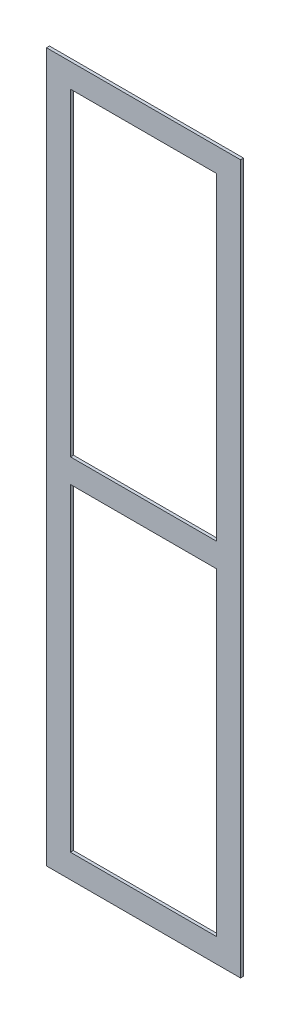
ISO-10303-21;
HEADER;
FILE_DESCRIPTION(('STEP AP214'),'2;1');
FILE_NAME('part.step','',(''),(''),'','','');
FILE_SCHEMA(('AUTOMOTIVE_DESIGN { 1 0 10303 214 1 1 1 1 }'));
ENDSEC;
DATA;
#1=APPLICATION_CONTEXT('core data for automotive mechanical design processes');
#2=APPLICATION_PROTOCOL_DEFINITION('international standard','automotive_design',2000,#1);
#3=PRODUCT_CONTEXT('',#1,'mechanical');
#4=PRODUCT('Part','Part','',(#3));
#5=PRODUCT_RELATED_PRODUCT_CATEGORY('part','',(#4));
#6=PRODUCT_DEFINITION_FORMATION('','',#4);
#7=PRODUCT_DEFINITION_CONTEXT('part definition',#1,'design');
#8=PRODUCT_DEFINITION('design','',#6,#7);
#9=PRODUCT_DEFINITION_SHAPE('','',#8);
#10=(LENGTH_UNIT() NAMED_UNIT(*) SI_UNIT(.MILLI.,.METRE.));
#11=(NAMED_UNIT(*) PLANE_ANGLE_UNIT() SI_UNIT($,.RADIAN.));
#12=(NAMED_UNIT(*) SI_UNIT($,.STERADIAN.) SOLID_ANGLE_UNIT());
#13=UNCERTAINTY_MEASURE_WITH_UNIT(LENGTH_MEASURE(1.E-05),#10,'distance_accuracy_value','');
#14=(GEOMETRIC_REPRESENTATION_CONTEXT(3) GLOBAL_UNCERTAINTY_ASSIGNED_CONTEXT((#13)) GLOBAL_UNIT_ASSIGNED_CONTEXT((#10,
#11,#12)) REPRESENTATION_CONTEXT('',''));
#15=CARTESIAN_POINT('',(0.,0.,0.));
#16=DIRECTION('',(0.,0.,1.));
#17=DIRECTION('',(1.,0.,0.));
#18=AXIS2_PLACEMENT_3D('',#15,#16,#17);
#19=CARTESIAN_POINT('',(0.,376.8,0.));
#20=DIRECTION('',(0.,-1.,0.));
#21=DIRECTION('',(0.,0.,-1.));
#22=AXIS2_PLACEMENT_3D('',#19,#20,#21);
#23=PLANE('',#22);
#24=DIRECTION('',(0.,0.,-1.));
#25=VECTOR('',#24,1.);
#26=CARTESIAN_POINT('',(51.5875,376.8,-51.5875));
#27=LINE('',#26,#25);
#28=CARTESIAN_POINT('',(51.5875,376.8,51.5875));
#29=VERTEX_POINT('',#28);
#30=CARTESIAN_POINT('',(51.5875,376.8,50.));
#31=VERTEX_POINT('',#30);
#32=EDGE_CURVE('E201',#29,#31,#27,.T.);
#33=ORIENTED_EDGE('',*,*,#32,.T.);
#34=DIRECTION('',(1.,0.,0.));
#35=VECTOR('',#34,1.);
#36=CARTESIAN_POINT('',(50.,376.8,50.));
#37=LINE('',#36,#35);
#38=CARTESIAN_POINT('',(-51.5875,376.8,50.));
#39=VERTEX_POINT('',#38);
#40=EDGE_CURVE('E54',#39,#31,#37,.T.);
#41=ORIENTED_EDGE('',*,*,#40,.F.);
#42=DIRECTION('',(0.,0.,1.));
#43=VECTOR('',#42,1.);
#44=CARTESIAN_POINT('',(-51.5875,376.8,-51.5875));
#45=LINE('',#44,#43);
#46=CARTESIAN_POINT('',(-51.5875,376.8,51.5875));
#47=VERTEX_POINT('',#46);
#48=EDGE_CURVE('E199',#39,#47,#45,.T.);
#49=ORIENTED_EDGE('',*,*,#48,.T.);
#50=DIRECTION('',(1.,0.,0.));
#51=VECTOR('',#50,1.);
#52=CARTESIAN_POINT('',(51.5875,376.8,51.5875));
#53=LINE('',#52,#51);
#54=EDGE_CURVE('E197',#47,#29,#53,.T.);
#55=ORIENTED_EDGE('',*,*,#54,.T.);
#56=EDGE_LOOP('',(#33,#41,#49,#55));
#57=FACE_BOUND('',#56,.T.);
#58=ADVANCED_FACE('F36',(#57),#23,.F.);
#59=CARTESIAN_POINT('',(0.,0.,0.));
#60=DIRECTION('',(0.,-1.,0.));
#61=DIRECTION('',(0.,0.,-1.));
#62=AXIS2_PLACEMENT_3D('',#59,#60,#61);
#63=PLANE('',#62);
#64=DIRECTION('',(1.,0.,0.));
#65=VECTOR('',#64,1.);
#66=CARTESIAN_POINT('',(-51.6,0.,50.));
#67=LINE('',#66,#65);
#68=CARTESIAN_POINT('',(-51.5875,0.,50.));
#69=VERTEX_POINT('',#68);
#70=CARTESIAN_POINT('',(51.5875,0.,50.));
#71=VERTEX_POINT('',#70);
#72=EDGE_CURVE('E195',#69,#71,#67,.T.);
#73=ORIENTED_EDGE('',*,*,#72,.T.);
#74=DIRECTION('',(0.,0.,-1.));
#75=VECTOR('',#74,1.);
#76=CARTESIAN_POINT('',(51.5875,0.,-51.5875));
#77=LINE('',#76,#75);
#78=CARTESIAN_POINT('',(51.5875,0.,51.5875));
#79=VERTEX_POINT('',#78);
#80=EDGE_CURVE('E196',#79,#71,#77,.T.);
#81=ORIENTED_EDGE('',*,*,#80,.F.);
#82=DIRECTION('',(1.,0.,0.));
#83=VECTOR('',#82,1.);
#84=CARTESIAN_POINT('',(51.5875,0.,51.5875));
#85=LINE('',#84,#83);
#86=CARTESIAN_POINT('',(-51.5875,0.,51.5875));
#87=VERTEX_POINT('',#86);
#88=EDGE_CURVE('E172',#87,#79,#85,.T.);
#89=ORIENTED_EDGE('',*,*,#88,.F.);
#90=DIRECTION('',(0.,0.,1.));
#91=VECTOR('',#90,1.);
#92=CARTESIAN_POINT('',(-51.5875,0.,-51.5875));
#93=LINE('',#92,#91);
#94=EDGE_CURVE('E193',#69,#87,#93,.T.);
#95=ORIENTED_EDGE('',*,*,#94,.F.);
#96=EDGE_LOOP('',(#73,#81,#89,#95));
#97=FACE_BOUND('',#96,.T.);
#98=ADVANCED_FACE('F249',(#97),#63,.T.);
#99=CARTESIAN_POINT('',(51.5875,376.8,-51.5875));
#100=DIRECTION('',(-1.,0.,0.));
#101=DIRECTION('',(0.,0.,1.));
#102=AXIS2_PLACEMENT_3D('',#99,#100,#101);
#103=PLANE('',#102);
#104=ORIENTED_EDGE('',*,*,#80,.T.);
#105=DIRECTION('',(0.,-1.,0.));
#106=VECTOR('',#105,1.);
#107=CARTESIAN_POINT('',(51.5875,376.8,50.));
#108=LINE('',#107,#106);
#109=EDGE_CURVE('E11',#31,#71,#108,.T.);
#110=ORIENTED_EDGE('',*,*,#109,.F.);
#111=ORIENTED_EDGE('',*,*,#32,.F.);
#112=DIRECTION('',(0.,-1.,0.));
#113=VECTOR('',#112,1.);
#114=CARTESIAN_POINT('',(51.5875,376.8,51.5875));
#115=LINE('',#114,#113);
#116=EDGE_CURVE('E194',#29,#79,#115,.T.);
#117=ORIENTED_EDGE('',*,*,#116,.T.);
#118=EDGE_LOOP('',(#104,#110,#111,#117));
#119=FACE_BOUND('',#118,.T.);
#120=ADVANCED_FACE('F253',(#119),#103,.F.);
#121=CARTESIAN_POINT('',(-51.5875,376.8,-51.5875));
#122=DIRECTION('',(1.,0.,0.));
#123=DIRECTION('',(0.,0.,-1.));
#124=AXIS2_PLACEMENT_3D('',#121,#122,#123);
#125=PLANE('',#124);
#126=ORIENTED_EDGE('',*,*,#48,.F.);
#127=DIRECTION('',(0.,-1.,0.));
#128=VECTOR('',#127,1.);
#129=CARTESIAN_POINT('',(-51.5875,376.8,50.));
#130=LINE('',#129,#128);
#131=EDGE_CURVE('E190',#39,#69,#130,.T.);
#132=ORIENTED_EDGE('',*,*,#131,.T.);
#133=ORIENTED_EDGE('',*,*,#94,.T.);
#134=DIRECTION('',(0.,-1.,0.));
#135=VECTOR('',#134,1.);
#136=CARTESIAN_POINT('',(-51.5875,376.8,51.5875));
#137=LINE('',#136,#135);
#138=EDGE_CURVE('E174',#47,#87,#137,.T.);
#139=ORIENTED_EDGE('',*,*,#138,.F.);
#140=EDGE_LOOP('',(#126,#132,#133,#139));
#141=FACE_BOUND('',#140,.T.);
#142=ADVANCED_FACE('F242',(#141),#125,.F.);
#143=CARTESIAN_POINT('',(-38.8874999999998,364.1,-51.6000000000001));
#144=DIRECTION('',(-1.,0.,0.));
#145=DIRECTION('',(0.,0.,1.));
#146=AXIS2_PLACEMENT_3D('',#143,#144,#145);
#147=PLANE('',#146);
#148=DIRECTION('',(0.,0.,1.));
#149=VECTOR('',#148,1.);
#150=CARTESIAN_POINT('',(-38.8875000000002,194.75,50.));
#151=LINE('',#150,#149);
#152=CARTESIAN_POINT('',(-38.8875000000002,194.75,50.));
#153=VERTEX_POINT('',#152);
#154=CARTESIAN_POINT('',(-38.8875000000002,194.75,51.5875));
#155=VERTEX_POINT('',#154);
#156=EDGE_CURVE('E142',#153,#155,#151,.T.);
#157=ORIENTED_EDGE('',*,*,#156,.F.);
#158=DIRECTION('',(0.,1.,0.));
#159=VECTOR('',#158,1.);
#160=CARTESIAN_POINT('',(-38.8875000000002,376.8,50.));
#161=LINE('',#160,#159);
#162=CARTESIAN_POINT('',(-38.8875000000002,364.1,50.));
#163=VERTEX_POINT('',#162);
#164=EDGE_CURVE('E204',#153,#163,#161,.T.);
#165=ORIENTED_EDGE('',*,*,#164,.T.);
#166=DIRECTION('',(0.,0.,1.));
#167=VECTOR('',#166,1.);
#168=CARTESIAN_POINT('',(-38.8874999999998,364.1,-51.6000000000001));
#169=LINE('',#168,#167);
#170=CARTESIAN_POINT('',(-38.8875000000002,364.1,51.5875));
#171=VERTEX_POINT('',#170);
#172=EDGE_CURVE('E151',#163,#171,#169,.T.);
#173=ORIENTED_EDGE('',*,*,#172,.T.);
#174=DIRECTION('',(0.,1.,0.));
#175=VECTOR('',#174,1.);
#176=CARTESIAN_POINT('',(-38.8875000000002,376.8,51.5875));
#177=LINE('',#176,#175);
#178=EDGE_CURVE('E139',#155,#171,#177,.T.);
#179=ORIENTED_EDGE('',*,*,#178,.F.);
#180=EDGE_LOOP('',(#157,#165,#173,#179));
#181=FACE_BOUND('',#180,.T.);
#182=ADVANCED_FACE('F149',(#181),#147,.F.);
#183=CARTESIAN_POINT('',(38.8875000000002,364.1,-51.5999999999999));
#184=DIRECTION('',(1.,0.,0.));
#185=DIRECTION('',(0.,0.,-1.));
#186=AXIS2_PLACEMENT_3D('',#183,#184,#185);
#187=PLANE('',#186);
#188=DIRECTION('',(0.,0.,1.));
#189=VECTOR('',#188,1.);
#190=CARTESIAN_POINT('',(38.8874999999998,194.75,50.));
#191=LINE('',#190,#189);
#192=CARTESIAN_POINT('',(38.8874999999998,194.75,50.));
#193=VERTEX_POINT('',#192);
#194=CARTESIAN_POINT('',(38.8874999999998,194.75,51.5875));
#195=VERTEX_POINT('',#194);
#196=EDGE_CURVE('E158',#193,#195,#191,.T.);
#197=ORIENTED_EDGE('',*,*,#196,.T.);
#198=DIRECTION('',(0.,-1.,0.));
#199=VECTOR('',#198,1.);
#200=CARTESIAN_POINT('',(38.8874999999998,376.8,51.5875));
#201=LINE('',#200,#199);
#202=CARTESIAN_POINT('',(38.8874999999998,364.1,51.5875));
#203=VERTEX_POINT('',#202);
#204=EDGE_CURVE('E141',#203,#195,#201,.T.);
#205=ORIENTED_EDGE('',*,*,#204,.F.);
#206=DIRECTION('',(0.,0.,1.));
#207=VECTOR('',#206,1.);
#208=CARTESIAN_POINT('',(38.8875000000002,364.1,-51.5999999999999));
#209=LINE('',#208,#207);
#210=CARTESIAN_POINT('',(38.8874999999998,364.1,50.));
#211=VERTEX_POINT('',#210);
#212=EDGE_CURVE('E180',#211,#203,#209,.T.);
#213=ORIENTED_EDGE('',*,*,#212,.F.);
#214=DIRECTION('',(0.,-1.,0.));
#215=VECTOR('',#214,1.);
#216=CARTESIAN_POINT('',(38.8874999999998,376.8,50.));
#217=LINE('',#216,#215);
#218=EDGE_CURVE('E153',#211,#193,#217,.T.);
#219=ORIENTED_EDGE('',*,*,#218,.T.);
#220=EDGE_LOOP('',(#197,#205,#213,#219));
#221=FACE_BOUND('',#220,.T.);
#222=ADVANCED_FACE('F233',(#221),#187,.F.);
#223=CARTESIAN_POINT('',(51.5875,376.8,51.5875));
#224=DIRECTION('',(0.,0.,-1.));
#225=DIRECTION('',(-1.,0.,0.));
#226=AXIS2_PLACEMENT_3D('',#223,#224,#225);
#227=PLANE('',#226);
#228=DIRECTION('',(1.,0.,0.));
#229=VECTOR('',#228,1.);
#230=CARTESIAN_POINT('',(0.,194.75,51.5875));
#231=LINE('',#230,#229);
#232=EDGE_CURVE('E92',#155,#195,#231,.T.);
#233=ORIENTED_EDGE('',*,*,#232,.F.);
#234=ORIENTED_EDGE('',*,*,#178,.T.);
#235=DIRECTION('',(1.,0.,0.));
#236=VECTOR('',#235,1.);
#237=CARTESIAN_POINT('',(51.5875,364.1,51.5875));
#238=LINE('',#237,#236);
#239=EDGE_CURVE('E152',#171,#203,#238,.T.);
#240=ORIENTED_EDGE('',*,*,#239,.T.);
#241=ORIENTED_EDGE('',*,*,#204,.T.);
#242=EDGE_LOOP('',(#233,#234,#240,#241));
#243=FACE_BOUND('',#242,.T.);
#244=CARTESIAN_POINT('',(-38.8875000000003,12.7,51.5875));
#245=VERTEX_POINT('',#244);
#246=CARTESIAN_POINT('',(-38.8875000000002,182.05,51.5875));
#247=VERTEX_POINT('',#246);
#248=EDGE_CURVE('E155',#245,#247,#177,.T.);
#249=ORIENTED_EDGE('',*,*,#248,.T.);
#250=DIRECTION('',(1.,0.,0.));
#251=VECTOR('',#250,1.);
#252=CARTESIAN_POINT('',(0.,182.05,51.5875));
#253=LINE('',#252,#251);
#254=CARTESIAN_POINT('',(38.8874999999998,182.05,51.5875));
#255=VERTEX_POINT('',#254);
#256=EDGE_CURVE('E164',#247,#255,#253,.T.);
#257=ORIENTED_EDGE('',*,*,#256,.T.);
#258=CARTESIAN_POINT('',(38.8874999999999,12.7,51.5875));
#259=VERTEX_POINT('',#258);
#260=EDGE_CURVE('E167',#255,#259,#201,.T.);
#261=ORIENTED_EDGE('',*,*,#260,.T.);
#262=DIRECTION('',(-1.,0.,0.));
#263=VECTOR('',#262,1.);
#264=CARTESIAN_POINT('',(51.5875,12.7,51.5875));
#265=LINE('',#264,#263);
#266=EDGE_CURVE('E169',#259,#245,#265,.T.);
#267=ORIENTED_EDGE('',*,*,#266,.T.);
#268=EDGE_LOOP('',(#249,#257,#261,#267));
#269=FACE_BOUND('',#268,.T.);
#270=ORIENTED_EDGE('',*,*,#88,.T.);
#271=ORIENTED_EDGE('',*,*,#116,.F.);
#272=ORIENTED_EDGE('',*,*,#54,.F.);
#273=ORIENTED_EDGE('',*,*,#138,.T.);
#274=EDGE_LOOP('',(#270,#271,#272,#273));
#275=FACE_BOUND('',#274,.T.);
#276=ADVANCED_FACE('F135',(#243,#269,#275),#227,.F.);
#277=CARTESIAN_POINT('',(50.,376.8,50.));
#278=DIRECTION('',(0.,0.,-1.));
#279=DIRECTION('',(-1.,0.,0.));
#280=AXIS2_PLACEMENT_3D('',#277,#278,#279);
#281=PLANE('',#280);
#282=ORIENTED_EDGE('',*,*,#164,.F.);
#283=DIRECTION('',(1.,0.,0.));
#284=VECTOR('',#283,1.);
#285=CARTESIAN_POINT('',(0.,194.75,50.));
#286=LINE('',#285,#284);
#287=EDGE_CURVE('E85',#153,#193,#286,.T.);
#288=ORIENTED_EDGE('',*,*,#287,.T.);
#289=ORIENTED_EDGE('',*,*,#218,.F.);
#290=DIRECTION('',(1.,0.,0.));
#291=VECTOR('',#290,1.);
#292=CARTESIAN_POINT('',(50.,364.1,50.));
#293=LINE('',#292,#291);
#294=EDGE_CURVE('E178',#163,#211,#293,.T.);
#295=ORIENTED_EDGE('',*,*,#294,.F.);
#296=EDGE_LOOP('',(#282,#288,#289,#295));
#297=FACE_BOUND('',#296,.T.);
#298=DIRECTION('',(1.,0.,0.));
#299=VECTOR('',#298,1.);
#300=CARTESIAN_POINT('',(0.,182.05,50.));
#301=LINE('',#300,#299);
#302=CARTESIAN_POINT('',(-38.8875000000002,182.05,50.));
#303=VERTEX_POINT('',#302);
#304=CARTESIAN_POINT('',(38.8874999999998,182.05,50.));
#305=VERTEX_POINT('',#304);
#306=EDGE_CURVE('E71',#303,#305,#301,.T.);
#307=ORIENTED_EDGE('',*,*,#306,.F.);
#308=CARTESIAN_POINT('',(-38.8875000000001,12.7,50.));
#309=VERTEX_POINT('',#308);
#310=EDGE_CURVE('E185',#309,#303,#161,.T.);
#311=ORIENTED_EDGE('',*,*,#310,.F.);
#312=DIRECTION('',(-1.,0.,0.));
#313=VECTOR('',#312,1.);
#314=CARTESIAN_POINT('',(50.,12.7,50.));
#315=LINE('',#314,#313);
#316=CARTESIAN_POINT('',(38.8874999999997,12.7,50.));
#317=VERTEX_POINT('',#316);
#318=EDGE_CURVE('E179',#317,#309,#315,.T.);
#319=ORIENTED_EDGE('',*,*,#318,.F.);
#320=EDGE_CURVE('E160',#305,#317,#217,.T.);
#321=ORIENTED_EDGE('',*,*,#320,.F.);
#322=EDGE_LOOP('',(#307,#311,#319,#321));
#323=FACE_BOUND('',#322,.T.);
#324=ORIENTED_EDGE('',*,*,#72,.F.);
#325=ORIENTED_EDGE('',*,*,#131,.F.);
#326=ORIENTED_EDGE('',*,*,#40,.T.);
#327=ORIENTED_EDGE('',*,*,#109,.T.);
#328=EDGE_LOOP('',(#324,#325,#326,#327));
#329=FACE_BOUND('',#328,.T.);
#330=ADVANCED_FACE('F230',(#297,#323,#329),#281,.T.);
#331=ORIENTED_EDGE('',*,*,#310,.T.);
#332=DIRECTION('',(0.,0.,1.));
#333=VECTOR('',#332,1.);
#334=CARTESIAN_POINT('',(-38.8875000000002,182.05,50.));
#335=LINE('',#334,#333);
#336=EDGE_CURVE('E182',#303,#247,#335,.T.);
#337=ORIENTED_EDGE('',*,*,#336,.T.);
#338=ORIENTED_EDGE('',*,*,#248,.F.);
#339=DIRECTION('',(0.,0.,1.));
#340=VECTOR('',#339,1.);
#341=CARTESIAN_POINT('',(-38.8874999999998,12.7,-51.6000000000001));
#342=LINE('',#341,#340);
#343=EDGE_CURVE('E39',#309,#245,#342,.T.);
#344=ORIENTED_EDGE('',*,*,#343,.F.);
#345=EDGE_LOOP('',(#331,#337,#338,#344));
#346=FACE_BOUND('',#345,.T.);
#347=ADVANCED_FACE('F244',(#346),#147,.F.);
#348=ORIENTED_EDGE('',*,*,#260,.F.);
#349=DIRECTION('',(0.,0.,1.));
#350=VECTOR('',#349,1.);
#351=CARTESIAN_POINT('',(38.8874999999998,182.05,50.));
#352=LINE('',#351,#350);
#353=EDGE_CURVE('E45',#305,#255,#352,.T.);
#354=ORIENTED_EDGE('',*,*,#353,.F.);
#355=ORIENTED_EDGE('',*,*,#320,.T.);
#356=DIRECTION('',(0.,0.,1.));
#357=VECTOR('',#356,1.);
#358=CARTESIAN_POINT('',(38.8875000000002,12.7,-51.5999999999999));
#359=LINE('',#358,#357);
#360=EDGE_CURVE('E209',#317,#259,#359,.T.);
#361=ORIENTED_EDGE('',*,*,#360,.T.);
#362=EDGE_LOOP('',(#348,#354,#355,#361));
#363=FACE_BOUND('',#362,.T.);
#364=ADVANCED_FACE('F236',(#363),#187,.F.);
#365=CARTESIAN_POINT('',(-38.8874999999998,364.1,-51.6000000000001));
#366=DIRECTION('',(0.,1.,0.));
#367=DIRECTION('',(0.,0.,1.));
#368=AXIS2_PLACEMENT_3D('',#365,#366,#367);
#369=PLANE('',#368);
#370=ORIENTED_EDGE('',*,*,#172,.F.);
#371=ORIENTED_EDGE('',*,*,#294,.T.);
#372=ORIENTED_EDGE('',*,*,#212,.T.);
#373=ORIENTED_EDGE('',*,*,#239,.F.);
#374=EDGE_LOOP('',(#370,#371,#372,#373));
#375=FACE_BOUND('',#374,.T.);
#376=ADVANCED_FACE('F227',(#375),#369,.F.);
#377=CARTESIAN_POINT('',(-38.8874999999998,12.7,-51.6000000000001));
#378=DIRECTION('',(0.,-1.,0.));
#379=DIRECTION('',(0.,0.,-1.));
#380=AXIS2_PLACEMENT_3D('',#377,#378,#379);
#381=PLANE('',#380);
#382=ORIENTED_EDGE('',*,*,#360,.F.);
#383=ORIENTED_EDGE('',*,*,#318,.T.);
#384=ORIENTED_EDGE('',*,*,#343,.T.);
#385=ORIENTED_EDGE('',*,*,#266,.F.);
#386=EDGE_LOOP('',(#382,#383,#384,#385));
#387=FACE_BOUND('',#386,.T.);
#388=ADVANCED_FACE('F273',(#387),#381,.F.);
#389=CARTESIAN_POINT('',(0.,194.75,50.));
#390=DIRECTION('',(0.,-1.,0.));
#391=DIRECTION('',(0.,0.,-1.));
#392=AXIS2_PLACEMENT_3D('',#389,#390,#391);
#393=PLANE('',#392);
#394=ORIENTED_EDGE('',*,*,#232,.T.);
#395=ORIENTED_EDGE('',*,*,#196,.F.);
#396=ORIENTED_EDGE('',*,*,#287,.F.);
#397=ORIENTED_EDGE('',*,*,#156,.T.);
#398=EDGE_LOOP('',(#394,#395,#396,#397));
#399=FACE_BOUND('',#398,.T.);
#400=ADVANCED_FACE('F144',(#399),#393,.F.);
#401=CARTESIAN_POINT('',(0.,182.05,50.));
#402=DIRECTION('',(0.,-1.,0.));
#403=DIRECTION('',(0.,0.,-1.));
#404=AXIS2_PLACEMENT_3D('',#401,#402,#403);
#405=PLANE('',#404);
#406=ORIENTED_EDGE('',*,*,#256,.F.);
#407=ORIENTED_EDGE('',*,*,#336,.F.);
#408=ORIENTED_EDGE('',*,*,#306,.T.);
#409=ORIENTED_EDGE('',*,*,#353,.T.);
#410=EDGE_LOOP('',(#406,#407,#408,#409));
#411=FACE_BOUND('',#410,.T.);
#412=ADVANCED_FACE('F281',(#411),#405,.T.);
#413=CLOSED_SHELL('',(#58,#98,#120,#142,#182,#222,#276,#330,#347,#364,#376,#388,#400,#412));
#414=MANIFOLD_SOLID_BREP('B2',#413);
#415=ADVANCED_BREP_SHAPE_REPRESENTATION('',(#18,#414),#14);
#416=SHAPE_DEFINITION_REPRESENTATION(#9,#415);
ENDSEC;
END-ISO-10303-21;
